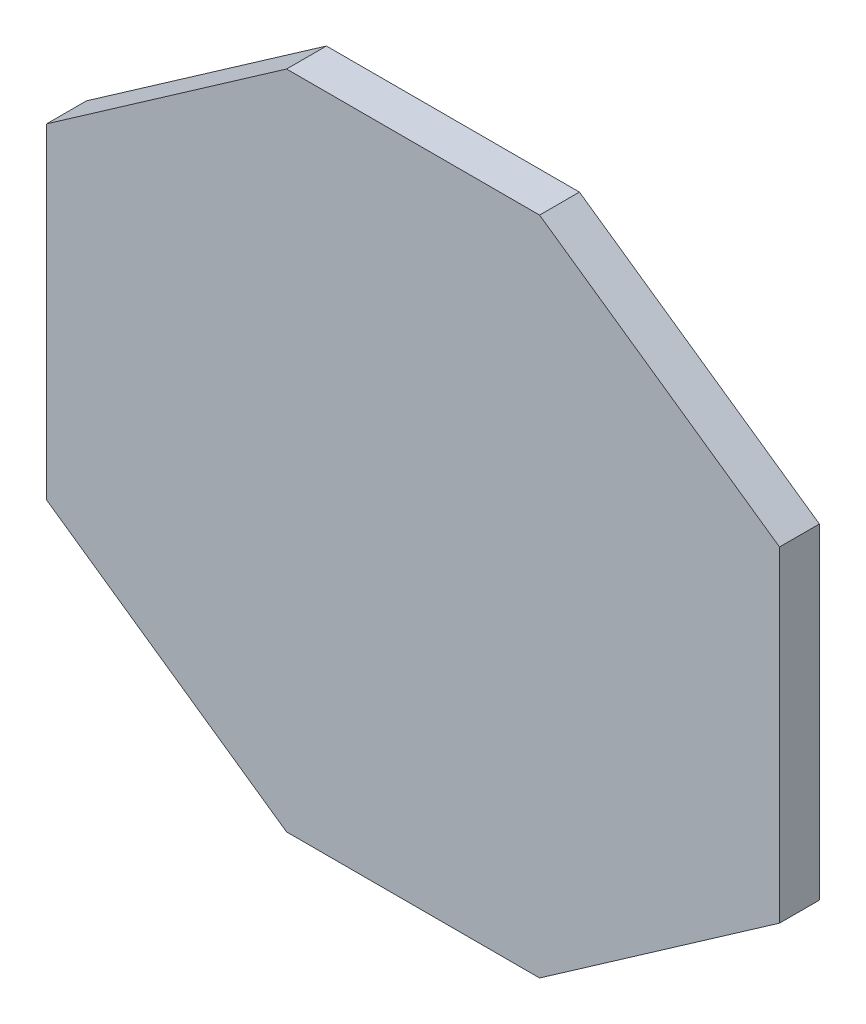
from build123d import *

# Parameters (mm, degrees)
BOSS_EXTRUDE1_DEPTH = 63.5


with BuildPart() as part:
    # Sketch2 → Boss-Extrude1 (new body)
    with BuildSketch(Plane(origin=(0, 0, 0), x_dir=(0, 1, 0), z_dir=(0, 0, 1))):
        Polygon((-259.64464443, 584.080268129), (-526.549268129, 201.642567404), (-526.549268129, -201.642567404), (-259.64464443, -584.080268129), (259.64464443, -584.080268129), (526.549268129, -201.642567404), (526.549268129, 201.642567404), (259.64464443, 584.080268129), align=None)
    extrude(amount=-BOSS_EXTRUDE1_DEPTH)


solid = part.part
